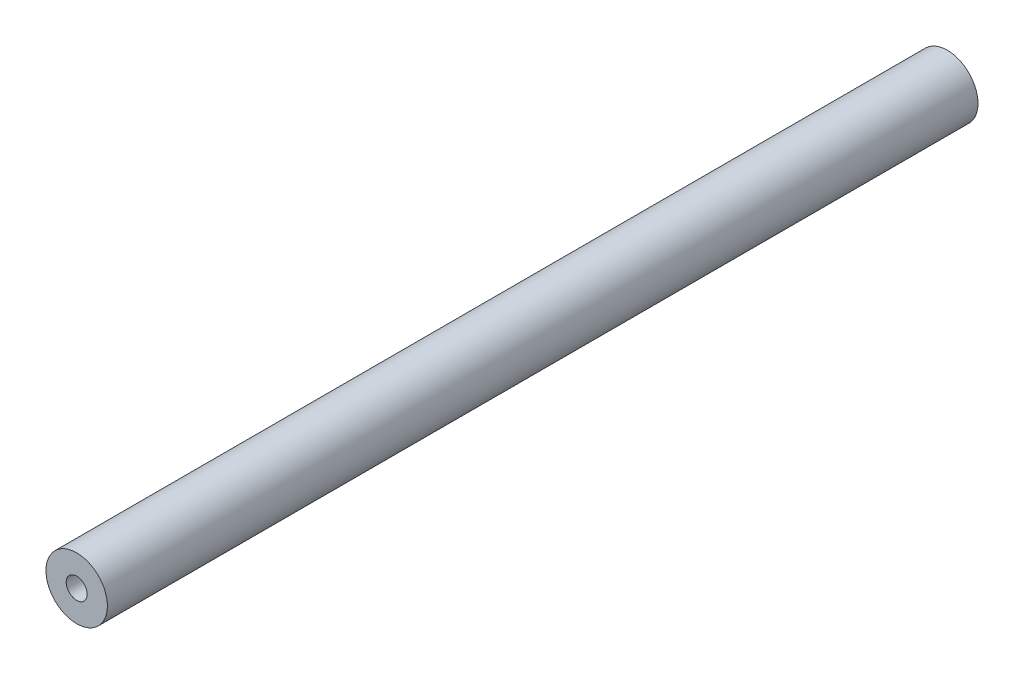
from build123d import *

# Parameters (mm, degrees)
ESBO_O1_R                                     = 3
RESSALTO_EXTRUS_O1_DEPTH                      = 85
BROCA_DE_ROSQUEAR_PARA_TARRAXA_DE_M2_52_D     = 2.05
BROCA_DE_ROSQUEAR_PARA_TARRAXA_DE_M2_52_DEPTH = 8
BROCA_DE_ROSQUEAR_PARA_TARRAXA_DE_M2_52_TIP   = 0.615882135


with BuildPart() as part:
    # Esbo_o1 → Ressalto-extrus_o1 (new body)
    with BuildSketch(Plane.XY):
        Circle(ESBO_O1_R)
    extrude(amount=RESSALTO_EXTRUS_O1_DEPTH)

    # Esbo_o2 → Broca de rosquear para tarraxa de M2.51 (revolve, cut)
    with BuildSketch(Plane(origin=(0, 0, 85), x_dir=(0, -1, 0), z_dir=(1, 0, 0))):
        Polygon((0, 0), (0, 8.615882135), (1.025, 8), (1.025, 0), align=None)
    revolve(axis=Axis((0, 0, 91.35), (0, 0, -1)), mode=Mode.SUBTRACT)

    # Broca de rosquear para tarraxa de M2.52
    with Locations(Plane(origin=(0, 0, 0), x_dir=(-1, 0, 0), z_dir=(0, 0, -1))):
        with Locations((0, 0)):
            Hole(BROCA_DE_ROSQUEAR_PARA_TARRAXA_DE_M2_52_D / 2, depth=BROCA_DE_ROSQUEAR_PARA_TARRAXA_DE_M2_52_DEPTH)
            with Locations((0, 0, -(BROCA_DE_ROSQUEAR_PARA_TARRAXA_DE_M2_52_DEPTH + BROCA_DE_ROSQUEAR_PARA_TARRAXA_DE_M2_52_TIP / 2))):  # 118° drill point
                Cone(0, BROCA_DE_ROSQUEAR_PARA_TARRAXA_DE_M2_52_D / 2, BROCA_DE_ROSQUEAR_PARA_TARRAXA_DE_M2_52_TIP, mode=Mode.SUBTRACT)


solid = part.part
